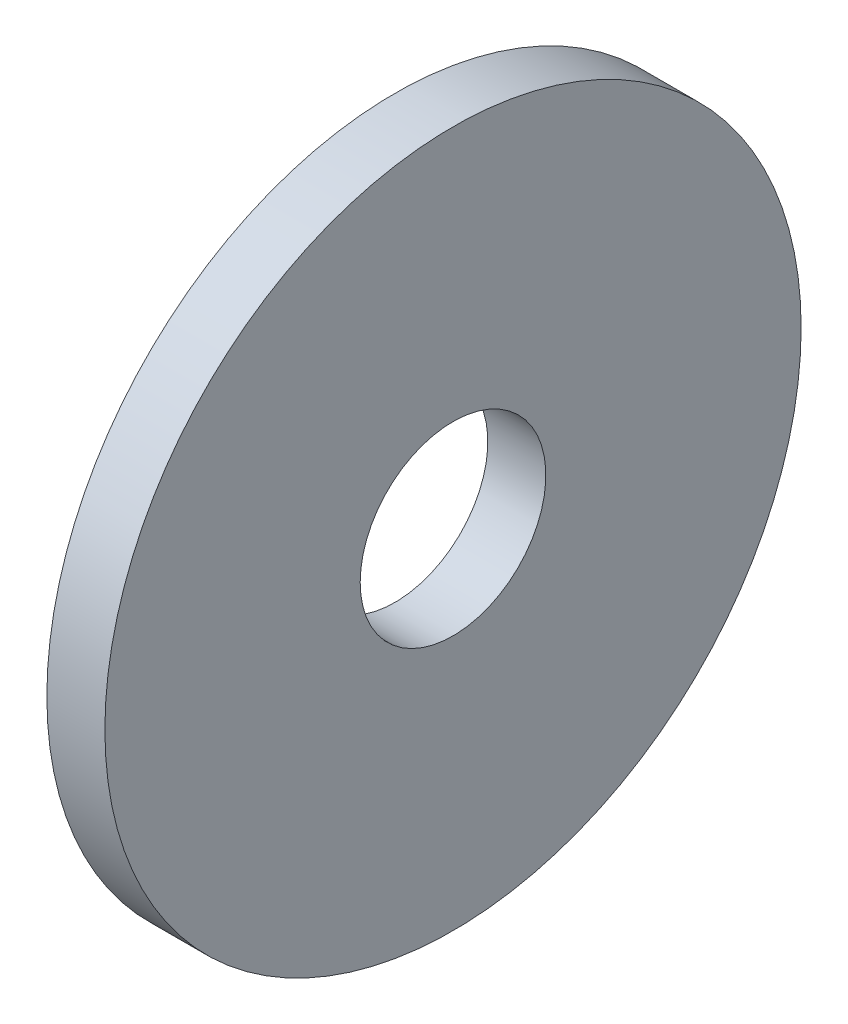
ISO-10303-21;
HEADER;
FILE_DESCRIPTION(('STEP AP214'),'2;1');
FILE_NAME('part.step','',(''),(''),'','','');
FILE_SCHEMA(('AUTOMOTIVE_DESIGN { 1 0 10303 214 1 1 1 1 }'));
ENDSEC;
DATA;
#1=APPLICATION_CONTEXT('core data for automotive mechanical design processes');
#2=APPLICATION_PROTOCOL_DEFINITION('international standard','automotive_design',2000,#1);
#3=PRODUCT_CONTEXT('',#1,'mechanical');
#4=PRODUCT('Part','Part','',(#3));
#5=PRODUCT_RELATED_PRODUCT_CATEGORY('part','',(#4));
#6=PRODUCT_DEFINITION_FORMATION('','',#4);
#7=PRODUCT_DEFINITION_CONTEXT('part definition',#1,'design');
#8=PRODUCT_DEFINITION('design','',#6,#7);
#9=PRODUCT_DEFINITION_SHAPE('','',#8);
#10=(LENGTH_UNIT() NAMED_UNIT(*) SI_UNIT(.MILLI.,.METRE.));
#11=(NAMED_UNIT(*) PLANE_ANGLE_UNIT() SI_UNIT($,.RADIAN.));
#12=(NAMED_UNIT(*) SI_UNIT($,.STERADIAN.) SOLID_ANGLE_UNIT());
#13=UNCERTAINTY_MEASURE_WITH_UNIT(LENGTH_MEASURE(1.E-05),#10,'distance_accuracy_value','');
#14=(GEOMETRIC_REPRESENTATION_CONTEXT(3) GLOBAL_UNCERTAINTY_ASSIGNED_CONTEXT((#13)) GLOBAL_UNIT_ASSIGNED_CONTEXT((#10,
#11,#12)) REPRESENTATION_CONTEXT('',''));
#15=CARTESIAN_POINT('',(0.,0.,0.));
#16=DIRECTION('',(0.,0.,1.));
#17=DIRECTION('',(1.,0.,0.));
#18=AXIS2_PLACEMENT_3D('',#15,#16,#17);
#19=CARTESIAN_POINT('',(0.,0.,-12.));
#20=DIRECTION('',(1.,0.,0.));
#21=DIRECTION('',(0.,0.,-1.));
#22=AXIS2_PLACEMENT_3D('',#19,#20,#21);
#23=PLANE('',#22);
#24=CARTESIAN_POINT('',(0.,0.,0.));
#25=DIRECTION('',(-1.,0.,0.));
#26=DIRECTION('',(0.,0.,1.));
#27=AXIS2_PLACEMENT_3D('',#24,#25,#26);
#28=CIRCLE('',#27,3.2);
#29=CARTESIAN_POINT('',(0.,0.,3.2));
#30=VERTEX_POINT('',#29);
#31=EDGE_CURVE('E10',#30,#30,#28,.T.);
#32=ORIENTED_EDGE('',*,*,#31,.F.);
#33=EDGE_LOOP('',(#32));
#34=FACE_BOUND('',#33,.T.);
#35=CARTESIAN_POINT('',(0.,0.,0.));
#36=DIRECTION('',(-1.,0.,0.));
#37=DIRECTION('',(0.,0.,1.));
#38=AXIS2_PLACEMENT_3D('',#35,#36,#37);
#39=CIRCLE('',#38,12.);
#40=CARTESIAN_POINT('',(0.,0.,12.));
#41=VERTEX_POINT('',#40);
#42=EDGE_CURVE('E363',#41,#41,#39,.T.);
#43=ORIENTED_EDGE('',*,*,#42,.T.);
#44=EDGE_LOOP('',(#43));
#45=FACE_BOUND('',#44,.T.);
#46=ADVANCED_FACE('F349',(#34,#45),#23,.F.);
#47=CARTESIAN_POINT('',(0.,0.,0.));
#48=DIRECTION('',(-1.,0.,0.));
#49=DIRECTION('',(0.,0.,1.));
#50=AXIS2_PLACEMENT_3D('',#47,#48,#49);
#51=CYLINDRICAL_SURFACE('',#50,3.2);
#52=CARTESIAN_POINT('',(2.,0.,0.));
#53=DIRECTION('',(-1.,0.,0.));
#54=DIRECTION('',(0.,0.,1.));
#55=AXIS2_PLACEMENT_3D('',#52,#53,#54);
#56=CIRCLE('',#55,3.2);
#57=CARTESIAN_POINT('',(2.,0.,3.2));
#58=VERTEX_POINT('',#57);
#59=EDGE_CURVE('E355',#58,#58,#56,.T.);
#60=ORIENTED_EDGE('',*,*,#59,.F.);
#61=EDGE_LOOP('',(#60));
#62=FACE_BOUND('',#61,.T.);
#63=ORIENTED_EDGE('',*,*,#31,.T.);
#64=EDGE_LOOP('',(#63));
#65=FACE_BOUND('',#64,.T.);
#66=ADVANCED_FACE('F378',(#62,#65),#51,.F.);
#67=CARTESIAN_POINT('',(2.,0.,-12.));
#68=DIRECTION('',(-1.,0.,0.));
#69=DIRECTION('',(0.,0.,1.));
#70=AXIS2_PLACEMENT_3D('',#67,#68,#69);
#71=PLANE('',#70);
#72=CARTESIAN_POINT('',(2.,0.,0.));
#73=DIRECTION('',(-1.,0.,0.));
#74=DIRECTION('',(0.,0.,1.));
#75=AXIS2_PLACEMENT_3D('',#72,#73,#74);
#76=CIRCLE('',#75,12.);
#77=CARTESIAN_POINT('',(2.,0.,12.));
#78=VERTEX_POINT('',#77);
#79=EDGE_CURVE('E359',#78,#78,#76,.T.);
#80=ORIENTED_EDGE('',*,*,#79,.F.);
#81=EDGE_LOOP('',(#80));
#82=FACE_BOUND('',#81,.T.);
#83=ORIENTED_EDGE('',*,*,#59,.T.);
#84=EDGE_LOOP('',(#83));
#85=FACE_BOUND('',#84,.T.);
#86=ADVANCED_FACE('F373',(#82,#85),#71,.F.);
#87=CARTESIAN_POINT('',(0.,0.,0.));
#88=DIRECTION('',(-1.,0.,0.));
#89=DIRECTION('',(0.,0.,1.));
#90=AXIS2_PLACEMENT_3D('',#87,#88,#89);
#91=CYLINDRICAL_SURFACE('',#90,12.);
#92=ORIENTED_EDGE('',*,*,#42,.F.);
#93=EDGE_LOOP('',(#92));
#94=FACE_BOUND('',#93,.T.);
#95=ORIENTED_EDGE('',*,*,#79,.T.);
#96=EDGE_LOOP('',(#95));
#97=FACE_BOUND('',#96,.T.);
#98=ADVANCED_FACE('F370',(#94,#97),#91,.T.);
#99=CLOSED_SHELL('',(#46,#66,#86,#98));
#100=MANIFOLD_SOLID_BREP('B2',#99);
#101=ADVANCED_BREP_SHAPE_REPRESENTATION('',(#18,#100),#14);
#102=SHAPE_DEFINITION_REPRESENTATION(#9,#101);
ENDSEC;
END-ISO-10303-21;
